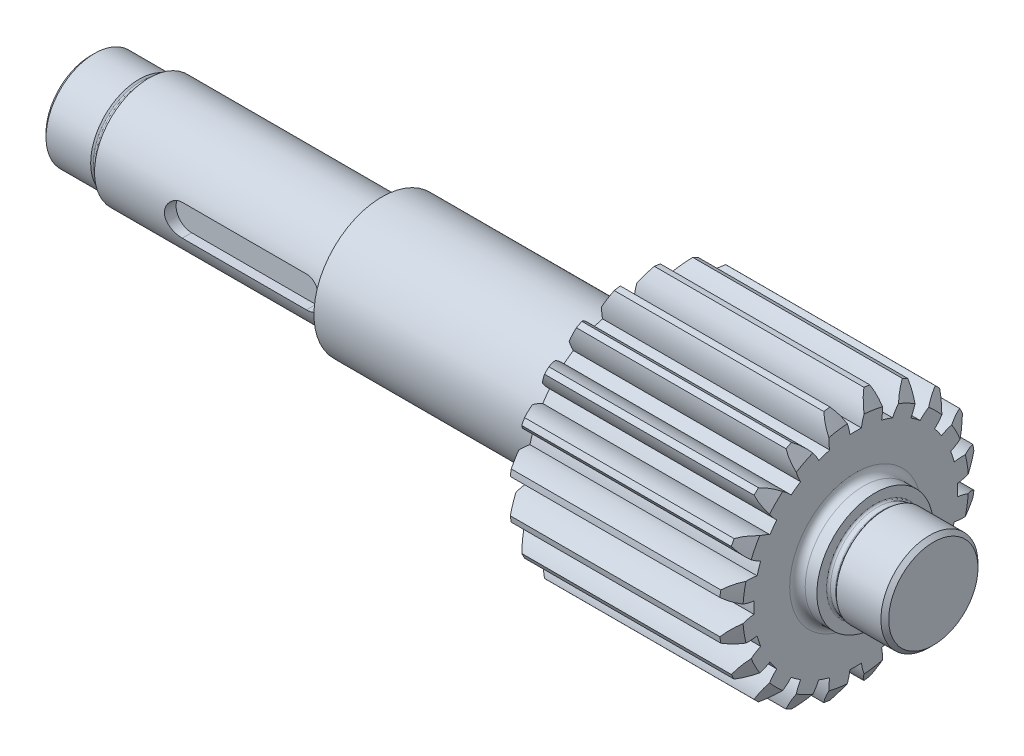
from build123d import *

# Parameters (mm, degrees)
BASPROSKE_W        = 58.5
BASPROSKE_H        = 33
TOOTHCUT_DEPTH     = 75.8348181
TEETHCUTS_COUNT    = 20
TEETHCUTS_ANGLE    = 342
CHAMFER1_SIZE      = 1
CUT_EXTRUDE2_DEPTH = 4
FILLET1_R          = 0.5
FILLET2_R          = 0.5
FILLET3_R          = 2


with BuildPart() as part:
    # BasProSke → Base-Revolve (revolve)
    with BuildSketch(Plane(origin=(0, 0, 0), x_dir=(1, 0, 0), z_dir=(0, 1, 0)), mode=Mode.PRIVATE) as base_revolve_sk:
        with Locations((29.25, 16.5)):
            Rectangle(BASPROSKE_W, BASPROSKE_H)
    revolve(base_revolve_sk.sketch.rotate(Axis((-10, 0, 0), (1, 0, 0)), 180), axis=Axis((-10, 0, 0), (1, 0, 0)))

    # TooCutSke → ToothCut (cut, through all)
    with BuildSketch(Plane(origin=(0, 0, 0), x_dir=(0, 0, -1), z_dir=(1, 0, 0))):
        with BuildLine():
            ThreePointArc((1.489278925, 26.206717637), (0, 26.249), (-1.489278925, 26.206717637))
            ThreePointArc((-1.489278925, 26.206717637), (-2.448651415, 29.690511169), (-4.401620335, 32.730762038))
            ThreePointArc((-4.401620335, 32.730762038), (0, 33.0254), (4.401620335, 32.730762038))
            ThreePointArc((4.401620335, 32.730762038), (2.448651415, 29.690511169), (1.489278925, 26.206717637))
        make_face()
    toothcut = extrude(amount=TOOTHCUT_DEPTH, mode=Mode.SUBTRACT)

    # TeethCuts: ToothCut ×20 about axis
    teethcuts_axis = Axis((-10, 0, 0), (1, 0, 0))
    for i in range(1, TEETHCUTS_COUNT):
        add(toothcut.rotate(teethcuts_axis, i * TEETHCUTS_ANGLE / (TEETHCUTS_COUNT - 1)), mode=Mode.SUBTRACT)

    # Sketch1 → Revolve1 (revolve)
    with BuildSketch(Plane.XY, mode=Mode.PRIVATE) as revolve1_sk:
        Polygon((58.5, 0), (58.5, 15), (63.5, 15), (63.5, 12.5), (78.5, 12.5), (78.5, 0), align=None)
        Polygon((0, 0), (0, 17.5), (-63.5, 17.5), (-63.5, 14), (-123.5, 14), (-123.5, 12.5), (-138.5, 12.5), (-138.5, 0), align=None)
    revolve(revolve1_sk.sketch.rotate(Axis((199.554039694, 0, 0), (-1, 0, 0)), 90), axis=Axis((199.554039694, 0, 0), (-1, 0, 0)))

    # Chamfer1
    chamfer1_edges = [part.edges().sort_by_distance(p)[0] for p in [
        (78.5, 0, 12.5),
        (-138.5, 0, 12.5),
    ]]
    chamfer(chamfer1_edges, length=CHAMFER1_SIZE)

    # Sketch2 → Cut-Revolve1 (revolve, cut)
    with BuildSketch(Plane.XY, mode=Mode.PRIVATE) as cut_revolve1_sk:
        Polygon((59, 33.207837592), (59, 28.207837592), (56.113248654, 33.207837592), align=None)
        Polygon((2.386751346, 33.207837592), (-0.5, 33.207837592), (-0.5, 28.207837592), align=None)
    revolve(cut_revolve1_sk.sketch.rotate(Axis((101.748417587, 0, 0), (-1, 0, 0)), 270), axis=Axis((101.748417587, 0, 0), (-1, 0, 0)), mode=Mode.SUBTRACT)

    # Sketch3 → Cut-Extrude2 (cut)
    with BuildSketch(Plane.XY.offset(15)):
        with BuildLine():
            Line((-101.5, 4), (-69.5, 4))
            ThreePointArc((-69.5, 4), (-65.5, 0), (-69.5, -4))
            Line((-69.5, -4), (-101.5, -4))
            ThreePointArc((-101.5, -4), (-105.5, 0), (-101.5, 4))
        make_face()
    extrude(amount=-CUT_EXTRUDE2_DEPTH, mode=Mode.SUBTRACT)

    # Sketch4 → Cut-Revolve2 (revolve, cut)
    with BuildSketch(Plane.XY):
        Polygon((63.5, 12.5), (63.5, 12), (65.5, 12), (66, 12.5), align=None)
        Polygon((-123.5, 12.5), (-123.5, 12), (-125.5, 12), (-126, 12.5), align=None)
    revolve(axis=Axis((104.211764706, 0, 0), (-1, 0, 0)), mode=Mode.SUBTRACT)

    # Fillet1
    fillet1_edges = [part.edges().sort_by_distance(p)[0] for p in [
        (63.5, -12, 0),
        (65.5, -12, 0),
        (-123.5, -12, 0),
        (-125.5, -12, 0),
    ]]
    fillet(fillet1_edges, radius=FILLET1_R)

    # Fillet2
    fillet2_edges = [part.edges().sort_by_distance(p)[0] for p in [
        (-63.5, 0, 14),
    ]]
    fillet(fillet2_edges, radius=FILLET2_R)

    # Fillet3
    fillet3_edges = [part.edges().sort_by_distance(p)[0] for p in [
        (58.5, 0, 15),
        (0, 0, 17.5),
    ]]
    fillet(fillet3_edges, radius=FILLET3_R)


solid = part.part
